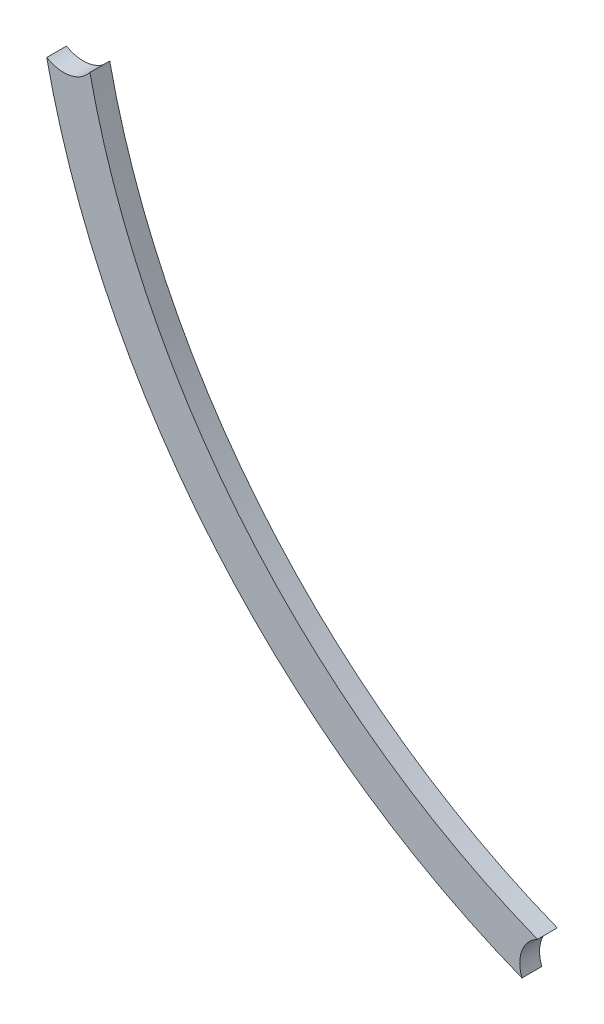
ISO-10303-21;
HEADER;
FILE_DESCRIPTION(('STEP AP214'),'2;1');
FILE_NAME('part.step','',(''),(''),'','','');
FILE_SCHEMA(('AUTOMOTIVE_DESIGN { 1 0 10303 214 1 1 1 1 }'));
ENDSEC;
DATA;
#1=APPLICATION_CONTEXT('core data for automotive mechanical design processes');
#2=APPLICATION_PROTOCOL_DEFINITION('international standard','automotive_design',2000,#1);
#3=PRODUCT_CONTEXT('',#1,'mechanical');
#4=PRODUCT('Part','Part','',(#3));
#5=PRODUCT_RELATED_PRODUCT_CATEGORY('part','',(#4));
#6=PRODUCT_DEFINITION_FORMATION('','',#4);
#7=PRODUCT_DEFINITION_CONTEXT('part definition',#1,'design');
#8=PRODUCT_DEFINITION('design','',#6,#7);
#9=PRODUCT_DEFINITION_SHAPE('','',#8);
#10=(LENGTH_UNIT() NAMED_UNIT(*) SI_UNIT(.MILLI.,.METRE.));
#11=(NAMED_UNIT(*) PLANE_ANGLE_UNIT() SI_UNIT($,.RADIAN.));
#12=(NAMED_UNIT(*) SI_UNIT($,.STERADIAN.) SOLID_ANGLE_UNIT());
#13=UNCERTAINTY_MEASURE_WITH_UNIT(LENGTH_MEASURE(1.E-05),#10,'distance_accuracy_value','');
#14=(GEOMETRIC_REPRESENTATION_CONTEXT(3) GLOBAL_UNCERTAINTY_ASSIGNED_CONTEXT((#13)) GLOBAL_UNIT_ASSIGNED_CONTEXT((#10,
#11,#12)) REPRESENTATION_CONTEXT('',''));
#15=CARTESIAN_POINT('',(0.,0.,0.));
#16=DIRECTION('',(0.,0.,1.));
#17=DIRECTION('',(1.,0.,0.));
#18=AXIS2_PLACEMENT_3D('',#15,#16,#17);
#19=CARTESIAN_POINT('',(0.,0.,11.43));
#20=DIRECTION('',(0.,0.,-1.));
#21=DIRECTION('',(-1.,0.,0.));
#22=AXIS2_PLACEMENT_3D('',#19,#20,#21);
#23=CYLINDRICAL_SURFACE('',#22,448.564);
#24=CARTESIAN_POINT('',(0.,0.,11.43));
#25=DIRECTION('',(0.,0.,1.));
#26=DIRECTION('',(1.,0.,0.));
#27=AXIS2_PLACEMENT_3D('',#24,#25,#26);
#28=CIRCLE('',#27,448.564);
#29=CARTESIAN_POINT('',(-438.464202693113,-94.65096435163,11.43));
#30=VERTEX_POINT('',#29);
#31=CARTESIAN_POINT('',(-164.388144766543,-417.356202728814,11.43));
#32=VERTEX_POINT('',#31);
#33=EDGE_CURVE('E90',#30,#32,#28,.T.);
#34=ORIENTED_EDGE('',*,*,#33,.F.);
#35=DIRECTION('',(0.,0.,1.));
#36=VECTOR('',#35,1.);
#37=CARTESIAN_POINT('',(-438.464202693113,-94.65096435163,5.715));
#38=LINE('',#37,#36);
#39=CARTESIAN_POINT('',(-438.464202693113,-94.65096435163,0.));
#40=VERTEX_POINT('',#39);
#41=EDGE_CURVE('E74',#30,#40,#38,.F.);
#42=ORIENTED_EDGE('',*,*,#41,.T.);
#43=CARTESIAN_POINT('',(0.,0.,0.));
#44=DIRECTION('',(0.,0.,1.));
#45=DIRECTION('',(1.,0.,0.));
#46=AXIS2_PLACEMENT_3D('',#43,#44,#45);
#47=CIRCLE('',#46,448.564);
#48=CARTESIAN_POINT('',(-164.388144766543,-417.356202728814,0.));
#49=VERTEX_POINT('',#48);
#50=EDGE_CURVE('E95',#40,#49,#47,.T.);
#51=ORIENTED_EDGE('',*,*,#50,.T.);
#52=DIRECTION('',(0.,0.,1.));
#53=VECTOR('',#52,1.);
#54=CARTESIAN_POINT('',(-164.388144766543,-417.356202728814,5.715));
#55=LINE('',#54,#53);
#56=EDGE_CURVE('E83',#49,#32,#55,.T.);
#57=ORIENTED_EDGE('',*,*,#56,.T.);
#58=EDGE_LOOP('',(#34,#42,#51,#57));
#59=FACE_BOUND('',#58,.T.);
#60=ADVANCED_FACE('F37',(#59),#23,.T.);
#61=CARTESIAN_POINT('',(0.,0.,11.43));
#62=DIRECTION('',(0.,0.,1.));
#63=DIRECTION('',(1.,0.,0.));
#64=AXIS2_PLACEMENT_3D('',#61,#62,#63);
#65=PLANE('',#64);
#66=CARTESIAN_POINT('',(-428.783504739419,-78.2440576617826,11.43));
#67=DIRECTION('',(0.,0.,1.));
#68=DIRECTION('',(1.,0.,0.));
#69=AXIS2_PLACEMENT_3D('',#66,#67,#68);
#70=CIRCLE('',#69,19.05);
#71=CARTESIAN_POINT('',(-413.551106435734,-89.6841862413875,11.43));
#72=VERTEX_POINT('',#71);
#73=EDGE_CURVE('E51',#30,#72,#70,.T.);
#74=ORIENTED_EDGE('',*,*,#73,.F.);
#75=ORIENTED_EDGE('',*,*,#33,.T.);
#76=CARTESIAN_POINT('',(-146.630410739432,-410.459436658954,11.43));
#77=DIRECTION('',(0.,0.,1.));
#78=DIRECTION('',(1.,0.,0.));
#79=AXIS2_PLACEMENT_3D('',#76,#77,#78);
#80=CIRCLE('',#79,19.05);
#81=CARTESIAN_POINT('',(-155.453545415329,-393.575870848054,11.43));
#82=VERTEX_POINT('',#81);
#83=EDGE_CURVE('E92',#82,#32,#80,.T.);
#84=ORIENTED_EDGE('',*,*,#83,.F.);
#85=CARTESIAN_POINT('',(0.,0.,11.43));
#86=DIRECTION('',(0.,0.,1.));
#87=DIRECTION('',(1.,0.,0.));
#88=AXIS2_PLACEMENT_3D('',#85,#86,#87);
#89=CIRCLE('',#88,423.164);
#90=EDGE_CURVE('E82',#72,#82,#89,.T.);
#91=ORIENTED_EDGE('',*,*,#90,.F.);
#92=EDGE_LOOP('',(#74,#75,#84,#91));
#93=FACE_BOUND('',#92,.T.);
#94=ADVANCED_FACE('F88',(#93),#65,.T.);
#95=CARTESIAN_POINT('',(0.,0.,0.));
#96=DIRECTION('',(0.,0.,1.));
#97=DIRECTION('',(1.,0.,0.));
#98=AXIS2_PLACEMENT_3D('',#95,#96,#97);
#99=PLANE('',#98);
#100=ORIENTED_EDGE('',*,*,#50,.F.);
#101=CARTESIAN_POINT('',(-428.783504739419,-78.2440576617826,0.));
#102=DIRECTION('',(0.,0.,1.));
#103=DIRECTION('',(1.,0.,0.));
#104=AXIS2_PLACEMENT_3D('',#101,#102,#103);
#105=CIRCLE('',#104,19.05);
#106=CARTESIAN_POINT('',(-413.551106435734,-89.6841862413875,0.));
#107=VERTEX_POINT('',#106);
#108=EDGE_CURVE('E77',#40,#107,#105,.T.);
#109=ORIENTED_EDGE('',*,*,#108,.T.);
#110=CARTESIAN_POINT('',(0.,0.,0.));
#111=DIRECTION('',(0.,0.,1.));
#112=DIRECTION('',(1.,0.,0.));
#113=AXIS2_PLACEMENT_3D('',#110,#111,#112);
#114=CIRCLE('',#113,423.164);
#115=CARTESIAN_POINT('',(-155.453545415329,-393.575870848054,0.));
#116=VERTEX_POINT('',#115);
#117=EDGE_CURVE('E97',#107,#116,#114,.T.);
#118=ORIENTED_EDGE('',*,*,#117,.T.);
#119=CARTESIAN_POINT('',(-146.630410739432,-410.459436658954,0.));
#120=DIRECTION('',(0.,0.,1.));
#121=DIRECTION('',(1.,0.,0.));
#122=AXIS2_PLACEMENT_3D('',#119,#120,#121);
#123=CIRCLE('',#122,19.05);
#124=EDGE_CURVE('E58',#116,#49,#123,.T.);
#125=ORIENTED_EDGE('',*,*,#124,.T.);
#126=EDGE_LOOP('',(#100,#109,#118,#125));
#127=FACE_BOUND('',#126,.T.);
#128=ADVANCED_FACE('F108',(#127),#99,.F.);
#129=CARTESIAN_POINT('',(0.,0.,0.));
#130=DIRECTION('',(0.,0.,1.));
#131=DIRECTION('',(1.,0.,0.));
#132=AXIS2_PLACEMENT_3D('',#129,#130,#131);
#133=CYLINDRICAL_SURFACE('',#132,423.164);
#134=ORIENTED_EDGE('',*,*,#117,.F.);
#135=DIRECTION('',(0.,0.,1.));
#136=VECTOR('',#135,1.);
#137=CARTESIAN_POINT('',(-413.551106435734,-89.6841862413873,5.715));
#138=LINE('',#137,#136);
#139=EDGE_CURVE('E11',#107,#72,#138,.T.);
#140=ORIENTED_EDGE('',*,*,#139,.T.);
#141=ORIENTED_EDGE('',*,*,#90,.T.);
#142=DIRECTION('',(0.,0.,1.));
#143=VECTOR('',#142,1.);
#144=CARTESIAN_POINT('',(-155.453545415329,-393.575870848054,5.715));
#145=LINE('',#144,#143);
#146=EDGE_CURVE('E44',#82,#116,#145,.F.);
#147=ORIENTED_EDGE('',*,*,#146,.T.);
#148=EDGE_LOOP('',(#134,#140,#141,#147));
#149=FACE_BOUND('',#148,.T.);
#150=ADVANCED_FACE('F110',(#149),#133,.F.);
#151=CARTESIAN_POINT('',(-146.630410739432,-410.459436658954,0.));
#152=DIRECTION('',(0.,0.,1.));
#153=DIRECTION('',(1.,0.,0.));
#154=AXIS2_PLACEMENT_3D('',#151,#152,#153);
#155=CYLINDRICAL_SURFACE('',#154,19.05);
#156=ORIENTED_EDGE('',*,*,#124,.F.);
#157=ORIENTED_EDGE('',*,*,#146,.F.);
#158=ORIENTED_EDGE('',*,*,#83,.T.);
#159=ORIENTED_EDGE('',*,*,#56,.F.);
#160=EDGE_LOOP('',(#156,#157,#158,#159));
#161=FACE_BOUND('',#160,.T.);
#162=ADVANCED_FACE('F111',(#161),#155,.F.);
#163=CARTESIAN_POINT('',(-428.783504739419,-78.2440576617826,0.));
#164=DIRECTION('',(0.,0.,1.));
#165=DIRECTION('',(1.,0.,0.));
#166=AXIS2_PLACEMENT_3D('',#163,#164,#165);
#167=CYLINDRICAL_SURFACE('',#166,19.05);
#168=ORIENTED_EDGE('',*,*,#73,.T.);
#169=ORIENTED_EDGE('',*,*,#139,.F.);
#170=ORIENTED_EDGE('',*,*,#108,.F.);
#171=ORIENTED_EDGE('',*,*,#41,.F.);
#172=EDGE_LOOP('',(#168,#169,#170,#171));
#173=FACE_BOUND('',#172,.T.);
#174=ADVANCED_FACE('F75',(#173),#167,.F.);
#175=CLOSED_SHELL('',(#60,#94,#128,#150,#162,#174));
#176=MANIFOLD_SOLID_BREP('B2',#175);
#177=ADVANCED_BREP_SHAPE_REPRESENTATION('',(#18,#176),#14);
#178=SHAPE_DEFINITION_REPRESENTATION(#9,#177);
ENDSEC;
END-ISO-10303-21;
